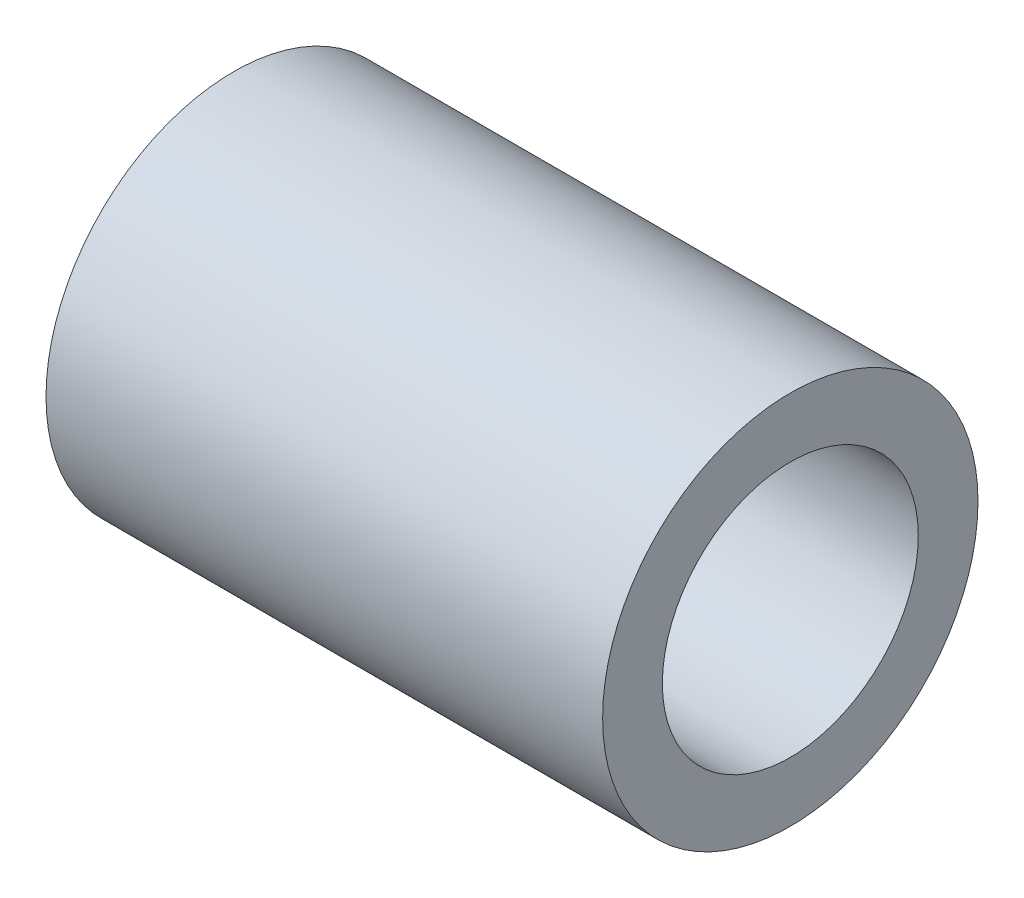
ISO-10303-21;
HEADER;
FILE_DESCRIPTION(('STEP AP214'),'2;1');
FILE_NAME('part.step','',(''),(''),'','','');
FILE_SCHEMA(('AUTOMOTIVE_DESIGN { 1 0 10303 214 1 1 1 1 }'));
ENDSEC;
DATA;
#1=APPLICATION_CONTEXT('core data for automotive mechanical design processes');
#2=APPLICATION_PROTOCOL_DEFINITION('international standard','automotive_design',2000,#1);
#3=PRODUCT_CONTEXT('',#1,'mechanical');
#4=PRODUCT('Part','Part','',(#3));
#5=PRODUCT_RELATED_PRODUCT_CATEGORY('part','',(#4));
#6=PRODUCT_DEFINITION_FORMATION('','',#4);
#7=PRODUCT_DEFINITION_CONTEXT('part definition',#1,'design');
#8=PRODUCT_DEFINITION('design','',#6,#7);
#9=PRODUCT_DEFINITION_SHAPE('','',#8);
#10=(LENGTH_UNIT() NAMED_UNIT(*) SI_UNIT(.MILLI.,.METRE.));
#11=(NAMED_UNIT(*) PLANE_ANGLE_UNIT() SI_UNIT($,.RADIAN.));
#12=(NAMED_UNIT(*) SI_UNIT($,.STERADIAN.) SOLID_ANGLE_UNIT());
#13=UNCERTAINTY_MEASURE_WITH_UNIT(LENGTH_MEASURE(1.E-05),#10,'distance_accuracy_value','');
#14=(GEOMETRIC_REPRESENTATION_CONTEXT(3) GLOBAL_UNCERTAINTY_ASSIGNED_CONTEXT((#13)) GLOBAL_UNIT_ASSIGNED_CONTEXT((#10,
#11,#12)) REPRESENTATION_CONTEXT('',''));
#15=CARTESIAN_POINT('',(0.,0.,0.));
#16=DIRECTION('',(0.,0.,1.));
#17=DIRECTION('',(1.,0.,0.));
#18=AXIS2_PLACEMENT_3D('',#15,#16,#17);
#19=CARTESIAN_POINT('',(0.,0.,0.));
#20=DIRECTION('',(1.,0.,0.));
#21=DIRECTION('',(0.,0.,-1.));
#22=AXIS2_PLACEMENT_3D('',#19,#20,#21);
#23=PLANE('',#22);
#24=CARTESIAN_POINT('',(0.,0.,0.));
#25=DIRECTION('',(-1.,0.,0.));
#26=DIRECTION('',(0.,0.,1.));
#27=AXIS2_PLACEMENT_3D('',#24,#25,#26);
#28=CIRCLE('',#27,6.);
#29=CARTESIAN_POINT('',(0.,0.,6.));
#30=VERTEX_POINT('',#29);
#31=EDGE_CURVE('E25',#30,#30,#28,.F.);
#32=ORIENTED_EDGE('',*,*,#31,.T.);
#33=EDGE_LOOP('',(#32));
#34=FACE_BOUND('',#33,.T.);
#35=CARTESIAN_POINT('',(0.,0.,0.));
#36=DIRECTION('',(-1.,0.,0.));
#37=DIRECTION('',(0.,0.,1.));
#38=AXIS2_PLACEMENT_3D('',#35,#36,#37);
#39=CIRCLE('',#38,8.8);
#40=CARTESIAN_POINT('',(0.,0.,8.8));
#41=VERTEX_POINT('',#40);
#42=EDGE_CURVE('E27',#41,#41,#39,.F.);
#43=ORIENTED_EDGE('',*,*,#42,.F.);
#44=EDGE_LOOP('',(#43));
#45=FACE_BOUND('',#44,.T.);
#46=ADVANCED_FACE('F14',(#34,#45),#23,.F.);
#47=CARTESIAN_POINT('',(3.5,0.,0.));
#48=DIRECTION('',(-1.,0.,0.));
#49=DIRECTION('',(0.,0.,1.));
#50=AXIS2_PLACEMENT_3D('',#47,#48,#49);
#51=CYLINDRICAL_SURFACE('',#50,8.8);
#52=ORIENTED_EDGE('',*,*,#42,.T.);
#53=EDGE_LOOP('',(#52));
#54=FACE_BOUND('',#53,.T.);
#55=CARTESIAN_POINT('',(26.1,0.,0.));
#56=DIRECTION('',(1.,0.,0.));
#57=DIRECTION('',(0.,0.,-1.));
#58=AXIS2_PLACEMENT_3D('',#55,#56,#57);
#59=CIRCLE('',#58,8.8);
#60=CARTESIAN_POINT('',(26.1,0.,-8.8));
#61=VERTEX_POINT('',#60);
#62=EDGE_CURVE('E18',#61,#61,#59,.T.);
#63=ORIENTED_EDGE('',*,*,#62,.F.);
#64=EDGE_LOOP('',(#63));
#65=FACE_BOUND('',#64,.T.);
#66=ADVANCED_FACE('F38',(#54,#65),#51,.T.);
#67=CARTESIAN_POINT('',(3.5,0.,0.));
#68=DIRECTION('',(-1.,0.,0.));
#69=DIRECTION('',(0.,0.,1.));
#70=AXIS2_PLACEMENT_3D('',#67,#68,#69);
#71=CYLINDRICAL_SURFACE('',#70,6.);
#72=ORIENTED_EDGE('',*,*,#31,.F.);
#73=EDGE_LOOP('',(#72));
#74=FACE_BOUND('',#73,.T.);
#75=CARTESIAN_POINT('',(26.1,0.,0.));
#76=DIRECTION('',(1.,0.,0.));
#77=DIRECTION('',(0.,0.,-1.));
#78=AXIS2_PLACEMENT_3D('',#75,#76,#77);
#79=CIRCLE('',#78,6.);
#80=CARTESIAN_POINT('',(26.1,0.,-6.));
#81=VERTEX_POINT('',#80);
#82=EDGE_CURVE('E10',#81,#81,#79,.F.);
#83=ORIENTED_EDGE('',*,*,#82,.F.);
#84=EDGE_LOOP('',(#83));
#85=FACE_BOUND('',#84,.T.);
#86=ADVANCED_FACE('F35',(#74,#85),#71,.F.);
#87=CARTESIAN_POINT('',(26.1,0.,0.));
#88=DIRECTION('',(1.,0.,0.));
#89=DIRECTION('',(0.,0.,-1.));
#90=AXIS2_PLACEMENT_3D('',#87,#88,#89);
#91=PLANE('',#90);
#92=ORIENTED_EDGE('',*,*,#82,.T.);
#93=EDGE_LOOP('',(#92));
#94=FACE_BOUND('',#93,.T.);
#95=ORIENTED_EDGE('',*,*,#62,.T.);
#96=EDGE_LOOP('',(#95));
#97=FACE_BOUND('',#96,.T.);
#98=ADVANCED_FACE('F16',(#94,#97),#91,.T.);
#99=CLOSED_SHELL('',(#46,#66,#86,#98));
#100=MANIFOLD_SOLID_BREP('B1',#99);
#101=ADVANCED_BREP_SHAPE_REPRESENTATION('',(#18,#100),#14);
#102=SHAPE_DEFINITION_REPRESENTATION(#9,#101);
ENDSEC;
END-ISO-10303-21;
